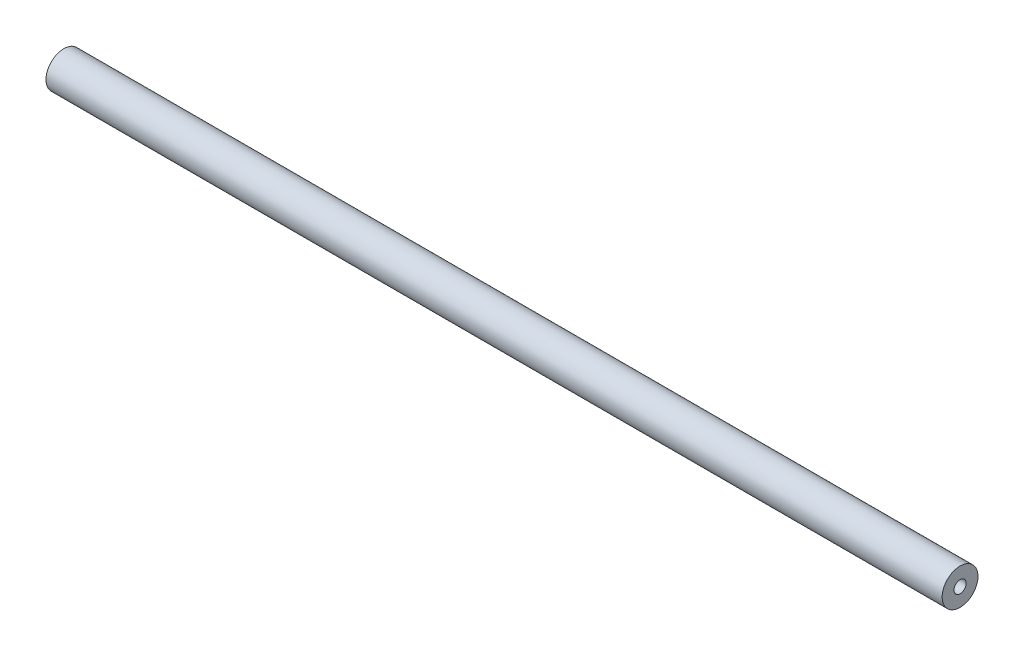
ISO-10303-21;
HEADER;
FILE_DESCRIPTION(('STEP AP214'),'2;1');
FILE_NAME('part.step','',(''),(''),'','','');
FILE_SCHEMA(('AUTOMOTIVE_DESIGN { 1 0 10303 214 1 1 1 1 }'));
ENDSEC;
DATA;
#1=APPLICATION_CONTEXT('core data for automotive mechanical design processes');
#2=APPLICATION_PROTOCOL_DEFINITION('international standard','automotive_design',2000,#1);
#3=PRODUCT_CONTEXT('',#1,'mechanical');
#4=PRODUCT('Part','Part','',(#3));
#5=PRODUCT_RELATED_PRODUCT_CATEGORY('part','',(#4));
#6=PRODUCT_DEFINITION_FORMATION('','',#4);
#7=PRODUCT_DEFINITION_CONTEXT('part definition',#1,'design');
#8=PRODUCT_DEFINITION('design','',#6,#7);
#9=PRODUCT_DEFINITION_SHAPE('','',#8);
#10=(LENGTH_UNIT() NAMED_UNIT(*) SI_UNIT(.MILLI.,.METRE.));
#11=(NAMED_UNIT(*) PLANE_ANGLE_UNIT() SI_UNIT($,.RADIAN.));
#12=(NAMED_UNIT(*) SI_UNIT($,.STERADIAN.) SOLID_ANGLE_UNIT());
#13=UNCERTAINTY_MEASURE_WITH_UNIT(LENGTH_MEASURE(1.E-05),#10,'distance_accuracy_value','');
#14=(GEOMETRIC_REPRESENTATION_CONTEXT(3) GLOBAL_UNCERTAINTY_ASSIGNED_CONTEXT((#13)) GLOBAL_UNIT_ASSIGNED_CONTEXT((#10,
#11,#12)) REPRESENTATION_CONTEXT('',''));
#15=CARTESIAN_POINT('',(0.,0.,0.));
#16=DIRECTION('',(0.,0.,1.));
#17=DIRECTION('',(1.,0.,0.));
#18=AXIS2_PLACEMENT_3D('',#15,#16,#17);
#19=CARTESIAN_POINT('',(250.,0.,-9.43689570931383E-13));
#20=DIRECTION('',(-1.,0.,0.));
#21=DIRECTION('',(0.,0.,1.));
#22=AXIS2_PLACEMENT_3D('',#19,#20,#21);
#23=CYLINDRICAL_SURFACE('',#22,10.);
#24=CARTESIAN_POINT('',(250.,0.,-9.43689570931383E-13));
#25=DIRECTION('',(1.,0.,0.));
#26=DIRECTION('',(0.,0.,-1.));
#27=AXIS2_PLACEMENT_3D('',#24,#25,#26);
#28=CIRCLE('',#27,10.);
#29=CARTESIAN_POINT('',(250.,0.,-10.0000000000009));
#30=VERTEX_POINT('',#29);
#31=EDGE_CURVE('E11',#30,#30,#28,.T.);
#32=ORIENTED_EDGE('',*,*,#31,.F.);
#33=EDGE_LOOP('',(#32));
#34=FACE_BOUND('',#33,.T.);
#35=CARTESIAN_POINT('',(-250.,1.88737914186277E-12,-9.43689570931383E-13));
#36=DIRECTION('',(1.,0.,0.));
#37=DIRECTION('',(0.,0.,-1.));
#38=AXIS2_PLACEMENT_3D('',#35,#36,#37);
#39=CIRCLE('',#38,10.);
#40=CARTESIAN_POINT('',(-250.,1.88737914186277E-12,-10.0000000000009));
#41=VERTEX_POINT('',#40);
#42=EDGE_CURVE('E50',#41,#41,#39,.T.);
#43=ORIENTED_EDGE('',*,*,#42,.T.);
#44=EDGE_LOOP('',(#43));
#45=FACE_BOUND('',#44,.T.);
#46=ADVANCED_FACE('F42',(#34,#45),#23,.T.);
#47=CARTESIAN_POINT('',(250.,0.,-9.43689570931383E-13));
#48=DIRECTION('',(1.,0.,0.));
#49=DIRECTION('',(0.,0.,-1.));
#50=AXIS2_PLACEMENT_3D('',#47,#48,#49);
#51=PLANE('',#50);
#52=CARTESIAN_POINT('',(250.,0.,-9.43689570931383E-13));
#53=DIRECTION('',(1.,0.,0.));
#54=DIRECTION('',(0.,0.,-1.));
#55=AXIS2_PLACEMENT_3D('',#52,#53,#54);
#56=CIRCLE('',#55,3.39999999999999);
#57=CARTESIAN_POINT('',(250.,0.,-3.40000000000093));
#58=VERTEX_POINT('',#57);
#59=EDGE_CURVE('E76',#58,#58,#56,.T.);
#60=ORIENTED_EDGE('',*,*,#59,.F.);
#61=EDGE_LOOP('',(#60));
#62=FACE_BOUND('',#61,.T.);
#63=ORIENTED_EDGE('',*,*,#31,.T.);
#64=EDGE_LOOP('',(#63));
#65=FACE_BOUND('',#64,.T.);
#66=ADVANCED_FACE('F87',(#62,#65),#51,.T.);
#67=CARTESIAN_POINT('',(-250.,1.88737914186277E-12,-9.43689570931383E-13));
#68=DIRECTION('',(1.,0.,0.));
#69=DIRECTION('',(0.,0.,-1.));
#70=AXIS2_PLACEMENT_3D('',#67,#68,#69);
#71=PLANE('',#70);
#72=CARTESIAN_POINT('',(-250.,1.88737914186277E-12,-9.43689570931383E-13));
#73=DIRECTION('',(-1.,0.,0.));
#74=DIRECTION('',(0.,0.,1.));
#75=AXIS2_PLACEMENT_3D('',#72,#73,#74);
#76=CIRCLE('',#75,3.39999999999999);
#77=CARTESIAN_POINT('',(-250.,1.88737914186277E-12,3.39999999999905));
#78=VERTEX_POINT('',#77);
#79=EDGE_CURVE('E66',#78,#78,#76,.T.);
#80=ORIENTED_EDGE('',*,*,#79,.F.);
#81=EDGE_LOOP('',(#80));
#82=FACE_BOUND('',#81,.T.);
#83=ORIENTED_EDGE('',*,*,#42,.F.);
#84=EDGE_LOOP('',(#83));
#85=FACE_BOUND('',#84,.T.);
#86=ADVANCED_FACE('F84',(#82,#85),#71,.F.);
#87=CARTESIAN_POINT('',(250.,0.,-9.43689570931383E-13));
#88=DIRECTION('',(1.,0.,0.));
#89=DIRECTION('',(0.,0.,-1.));
#90=AXIS2_PLACEMENT_3D('',#87,#88,#89);
#91=CYLINDRICAL_SURFACE('',#90,3.39999999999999);
#92=CARTESIAN_POINT('',(230.,0.,0.));
#93=DIRECTION('',(1.,0.,0.));
#94=DIRECTION('',(0.,0.,-1.));
#95=AXIS2_PLACEMENT_3D('',#92,#93,#94);
#96=CIRCLE('',#95,3.39999999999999);
#97=CARTESIAN_POINT('',(230.,0.,-3.39999999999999));
#98=VERTEX_POINT('',#97);
#99=EDGE_CURVE('E71',#98,#98,#96,.T.);
#100=ORIENTED_EDGE('',*,*,#99,.F.);
#101=EDGE_LOOP('',(#100));
#102=FACE_BOUND('',#101,.T.);
#103=ORIENTED_EDGE('',*,*,#59,.T.);
#104=EDGE_LOOP('',(#103));
#105=FACE_BOUND('',#104,.T.);
#106=ADVANCED_FACE('F86',(#102,#105),#91,.F.);
#107=CARTESIAN_POINT('',(230.,0.,0.));
#108=DIRECTION('',(1.,0.,0.));
#109=DIRECTION('',(0.,0.,-1.));
#110=AXIS2_PLACEMENT_3D('',#107,#108,#109);
#111=CONICAL_SURFACE('',#110,3.39999999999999,1.02974425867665);
#112=CARTESIAN_POINT('',(227.957073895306,0.,0.));
#113=VERTEX_POINT('',#112);
#114=VERTEX_LOOP('',#113);
#115=FACE_BOUND('',#114,.T.);
#116=ORIENTED_EDGE('',*,*,#99,.T.);
#117=EDGE_LOOP('',(#116));
#118=FACE_BOUND('',#117,.T.);
#119=ADVANCED_FACE('F94',(#115,#118),#111,.F.);
#120=CARTESIAN_POINT('',(-250.,1.88737914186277E-12,-9.43689570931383E-13));
#121=DIRECTION('',(-1.,0.,0.));
#122=DIRECTION('',(0.,0.,1.));
#123=AXIS2_PLACEMENT_3D('',#120,#121,#122);
#124=CYLINDRICAL_SURFACE('',#123,3.39999999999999);
#125=CARTESIAN_POINT('',(-230.,1.88737914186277E-12,-9.43689570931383E-13));
#126=DIRECTION('',(-1.,0.,0.));
#127=DIRECTION('',(0.,0.,1.));
#128=AXIS2_PLACEMENT_3D('',#125,#126,#127);
#129=CIRCLE('',#128,3.39999999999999);
#130=CARTESIAN_POINT('',(-230.,1.88737914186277E-12,3.39999999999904));
#131=VERTEX_POINT('',#130);
#132=EDGE_CURVE('E63',#131,#131,#129,.T.);
#133=ORIENTED_EDGE('',*,*,#132,.F.);
#134=EDGE_LOOP('',(#133));
#135=FACE_BOUND('',#134,.T.);
#136=ORIENTED_EDGE('',*,*,#79,.T.);
#137=EDGE_LOOP('',(#136));
#138=FACE_BOUND('',#137,.T.);
#139=ADVANCED_FACE('F59',(#135,#138),#124,.F.);
#140=CARTESIAN_POINT('',(-230.,1.88737914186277E-12,-9.43689570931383E-13));
#141=DIRECTION('',(-1.,0.,0.));
#142=DIRECTION('',(0.,0.,1.));
#143=AXIS2_PLACEMENT_3D('',#140,#141,#142);
#144=CONICAL_SURFACE('',#143,3.39999999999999,1.02974425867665);
#145=CARTESIAN_POINT('',(-227.957073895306,1.88737914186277E-12,-9.43689570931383E-13));
#146=VERTEX_POINT('',#145);
#147=VERTEX_LOOP('',#146);
#148=FACE_BOUND('',#147,.T.);
#149=ORIENTED_EDGE('',*,*,#132,.T.);
#150=EDGE_LOOP('',(#149));
#151=FACE_BOUND('',#150,.T.);
#152=ADVANCED_FACE('F56',(#148,#151),#144,.F.);
#153=CLOSED_SHELL('',(#46,#66,#86,#106,#119,#139,#152));
#154=MANIFOLD_SOLID_BREP('B2',#153);
#155=ADVANCED_BREP_SHAPE_REPRESENTATION('',(#18,#154),#14);
#156=SHAPE_DEFINITION_REPRESENTATION(#9,#155);
ENDSEC;
END-ISO-10303-21;
